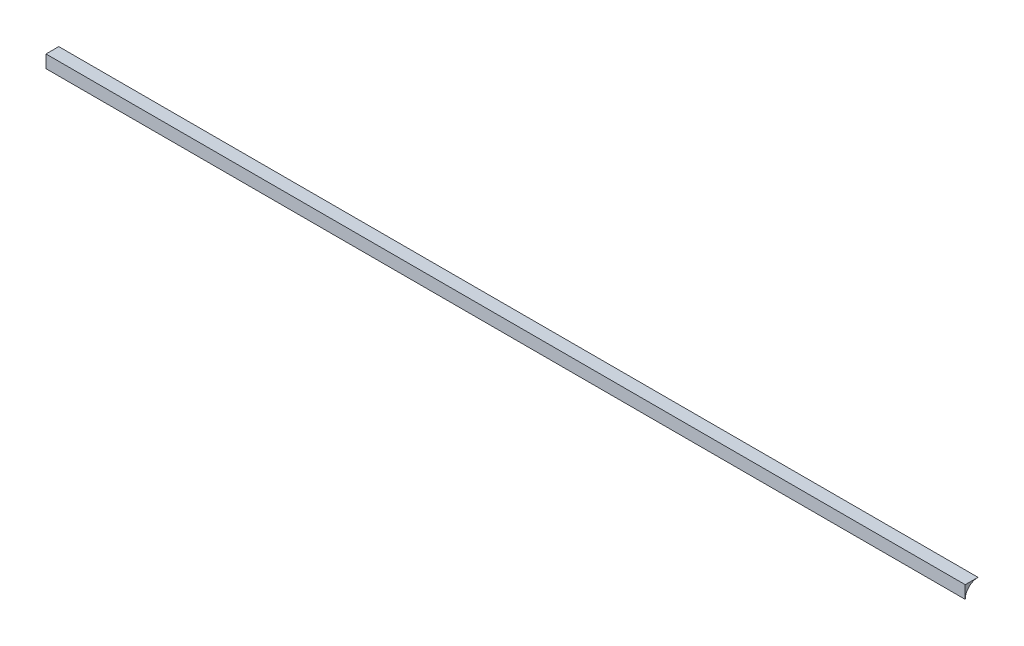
from build123d import *


with BuildPart() as part:
    # Sketch1 → Applied_tapered_corner_caulk section 0
    with BuildSketch(Plane.YZ):
        with BuildLine():
            Line((76.2, 76.2), (73.025, 76.2))
            Line((73.025, 76.2), (73.644411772, 76.138993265))
            Line((73.644411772, 76.138993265), (74.240019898, 75.958317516))
            Line((74.240019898, 75.958317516), (74.78893549, 75.664916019))
            Line((74.78893549, 75.664916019), (75.27006403, 75.27006403))
            Line((75.27006403, 75.27006403), (75.664916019, 74.78893549))
            Line((75.664916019, 74.78893549), (75.958317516, 74.240019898))
            Line((75.958317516, 74.240019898), (76.138993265, 73.644411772))
            Line((76.138993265, 73.644411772), (76.2, 73.025))
            Line((76.2, 73.025), (76.2, 76.2))
        make_face()
    # Sketch2 → Applied_tapered_corner_caulk section 1
    with BuildSketch(Plane.YZ.offset(304.8)):
        with BuildLine():
            Line((152.4, 152.4), (149.225, 152.4))
            Line((149.225, 152.4), (149.844411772, 152.338993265))
            Line((149.844411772, 152.338993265), (150.440019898, 152.158317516))
            Line((150.440019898, 152.158317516), (150.98893549, 151.864916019))
            Line((150.98893549, 151.864916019), (151.47006403, 151.47006403))
            Line((151.47006403, 151.47006403), (151.864916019, 150.98893549))
            Line((151.864916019, 150.98893549), (152.158317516, 150.440019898))
            Line((152.158317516, 150.440019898), (152.338993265, 149.844411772))
            Line((152.338993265, 149.844411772), (152.4, 149.225))
            Line((152.4, 149.225), (152.4, 152.4))
        make_face()
    loft()


solid = part.part
